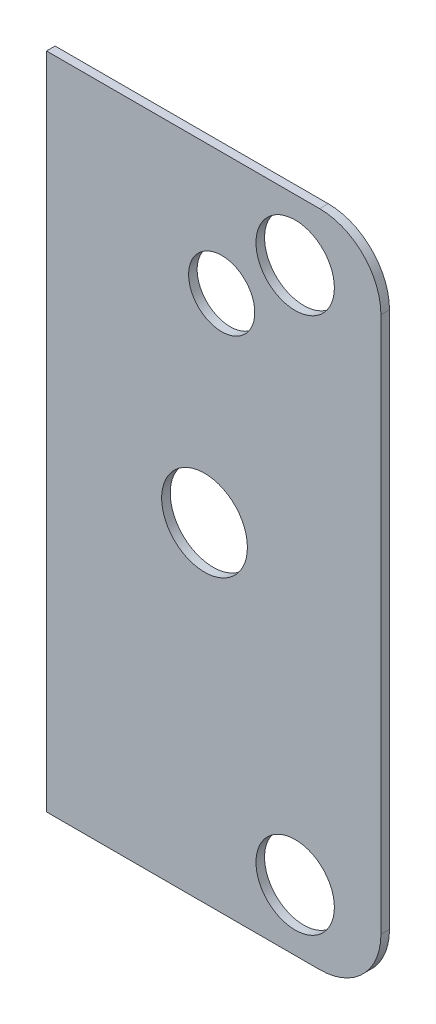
ISO-10303-21;
HEADER;
FILE_DESCRIPTION(('STEP AP214'),'2;1');
FILE_NAME('part.step','',(''),(''),'','','');
FILE_SCHEMA(('AUTOMOTIVE_DESIGN { 1 0 10303 214 1 1 1 1 }'));
ENDSEC;
DATA;
#1=APPLICATION_CONTEXT('core data for automotive mechanical design processes');
#2=APPLICATION_PROTOCOL_DEFINITION('international standard','automotive_design',2000,#1);
#3=PRODUCT_CONTEXT('',#1,'mechanical');
#4=PRODUCT('Part','Part','',(#3));
#5=PRODUCT_RELATED_PRODUCT_CATEGORY('part','',(#4));
#6=PRODUCT_DEFINITION_FORMATION('','',#4);
#7=PRODUCT_DEFINITION_CONTEXT('part definition',#1,'design');
#8=PRODUCT_DEFINITION('design','',#6,#7);
#9=PRODUCT_DEFINITION_SHAPE('','',#8);
#10=(LENGTH_UNIT() NAMED_UNIT(*) SI_UNIT(.MILLI.,.METRE.));
#11=(NAMED_UNIT(*) PLANE_ANGLE_UNIT() SI_UNIT($,.RADIAN.));
#12=(NAMED_UNIT(*) SI_UNIT($,.STERADIAN.) SOLID_ANGLE_UNIT());
#13=UNCERTAINTY_MEASURE_WITH_UNIT(LENGTH_MEASURE(1.E-05),#10,'distance_accuracy_value','');
#14=(GEOMETRIC_REPRESENTATION_CONTEXT(3) GLOBAL_UNCERTAINTY_ASSIGNED_CONTEXT((#13)) GLOBAL_UNIT_ASSIGNED_CONTEXT((#10,
#11,#12)) REPRESENTATION_CONTEXT('',''));
#15=CARTESIAN_POINT('',(0.,0.,0.));
#16=DIRECTION('',(0.,0.,1.));
#17=DIRECTION('',(1.,0.,0.));
#18=AXIS2_PLACEMENT_3D('',#15,#16,#17);
#19=CARTESIAN_POINT('',(0.,0.,0.7));
#20=DIRECTION('',(0.,0.,1.));
#21=DIRECTION('',(1.,0.,0.));
#22=AXIS2_PLACEMENT_3D('',#19,#20,#21);
#23=PLANE('',#22);
#24=CARTESIAN_POINT('',(21.9,16.9,0.7));
#25=DIRECTION('',(0.,0.,1.));
#26=DIRECTION('',(1.,0.,0.));
#27=AXIS2_PLACEMENT_3D('',#24,#25,#26);
#28=CIRCLE('',#27,2.7);
#29=CARTESIAN_POINT('',(24.6,16.9,0.7));
#30=VERTEX_POINT('',#29);
#31=EDGE_CURVE('E214',#30,#30,#28,.T.);
#32=ORIENTED_EDGE('',*,*,#31,.F.);
#33=EDGE_LOOP('',(#32));
#34=FACE_BOUND('',#33,.T.);
#35=CARTESIAN_POINT('',(27.9,21.9,0.699999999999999));
#36=DIRECTION('',(0.,0.,1.));
#37=DIRECTION('',(1.,0.,0.));
#38=AXIS2_PLACEMENT_3D('',#35,#36,#37);
#39=CIRCLE('',#38,3.2);
#40=CARTESIAN_POINT('',(31.1,21.9,0.699999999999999));
#41=VERTEX_POINT('',#40);
#42=EDGE_CURVE('E169',#41,#41,#39,.T.);
#43=ORIENTED_EDGE('',*,*,#42,.F.);
#44=EDGE_LOOP('',(#43));
#45=FACE_BOUND('',#44,.T.);
#46=CARTESIAN_POINT('',(27.9,-21.9,0.699999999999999));
#47=DIRECTION('',(0.,0.,1.));
#48=DIRECTION('',(1.,0.,0.));
#49=AXIS2_PLACEMENT_3D('',#46,#47,#48);
#50=CIRCLE('',#49,3.2);
#51=CARTESIAN_POINT('',(31.1,-21.9,0.699999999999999));
#52=VERTEX_POINT('',#51);
#53=EDGE_CURVE('E165',#52,#52,#50,.T.);
#54=ORIENTED_EDGE('',*,*,#53,.F.);
#55=EDGE_LOOP('',(#54));
#56=FACE_BOUND('',#55,.T.);
#57=CARTESIAN_POINT('',(20.5,0.,0.7));
#58=DIRECTION('',(0.,0.,1.));
#59=DIRECTION('',(1.,0.,0.));
#60=AXIS2_PLACEMENT_3D('',#57,#58,#59);
#61=CIRCLE('',#60,3.5);
#62=CARTESIAN_POINT('',(24.,0.,0.7));
#63=VERTEX_POINT('',#62);
#64=EDGE_CURVE('E161',#63,#63,#61,.T.);
#65=ORIENTED_EDGE('',*,*,#64,.F.);
#66=EDGE_LOOP('',(#65));
#67=FACE_BOUND('',#66,.T.);
#68=DIRECTION('',(1.,0.,0.));
#69=VECTOR('',#68,1.);
#70=CARTESIAN_POINT('',(0.,26.9,0.7));
#71=LINE('',#70,#69);
#72=CARTESIAN_POINT('',(7.59999999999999,26.9,0.7));
#73=VERTEX_POINT('',#72);
#74=CARTESIAN_POINT('',(29.9,26.9,0.7));
#75=VERTEX_POINT('',#74);
#76=EDGE_CURVE('E112',#73,#75,#71,.T.);
#77=ORIENTED_EDGE('',*,*,#76,.F.);
#78=DIRECTION('',(0.,-1.,0.));
#79=VECTOR('',#78,1.);
#80=CARTESIAN_POINT('',(7.6,0.,0.7));
#81=LINE('',#80,#79);
#82=CARTESIAN_POINT('',(7.6,-26.9,0.7));
#83=VERTEX_POINT('',#82);
#84=EDGE_CURVE('E103',#73,#83,#81,.T.);
#85=ORIENTED_EDGE('',*,*,#84,.T.);
#86=DIRECTION('',(1.,0.,0.));
#87=VECTOR('',#86,1.);
#88=CARTESIAN_POINT('',(0.,-26.9,0.7));
#89=LINE('',#88,#87);
#90=CARTESIAN_POINT('',(29.9,-26.9,0.7));
#91=VERTEX_POINT('',#90);
#92=EDGE_CURVE('E110',#83,#91,#89,.T.);
#93=ORIENTED_EDGE('',*,*,#92,.T.);
#94=CARTESIAN_POINT('',(29.9,-21.9,0.7));
#95=DIRECTION('',(0.,0.,1.));
#96=DIRECTION('',(1.,0.,0.));
#97=AXIS2_PLACEMENT_3D('',#94,#95,#96);
#98=CIRCLE('',#97,5.);
#99=CARTESIAN_POINT('',(34.9,-21.9,0.7));
#100=VERTEX_POINT('',#99);
#101=EDGE_CURVE('E121',#100,#91,#98,.F.);
#102=ORIENTED_EDGE('',*,*,#101,.F.);
#103=DIRECTION('',(0.,-1.,0.));
#104=VECTOR('',#103,1.);
#105=CARTESIAN_POINT('',(34.9,0.,0.7));
#106=LINE('',#105,#104);
#107=CARTESIAN_POINT('',(34.9,21.9,0.7));
#108=VERTEX_POINT('',#107);
#109=EDGE_CURVE('E129',#108,#100,#106,.T.);
#110=ORIENTED_EDGE('',*,*,#109,.F.);
#111=CARTESIAN_POINT('',(29.9,21.9,0.7));
#112=DIRECTION('',(0.,0.,1.));
#113=DIRECTION('',(1.,0.,0.));
#114=AXIS2_PLACEMENT_3D('',#111,#112,#113);
#115=CIRCLE('',#114,5.);
#116=EDGE_CURVE('E190',#75,#108,#115,.F.);
#117=ORIENTED_EDGE('',*,*,#116,.F.);
#118=EDGE_LOOP('',(#77,#85,#93,#102,#110,#117));
#119=FACE_BOUND('',#118,.T.);
#120=ADVANCED_FACE('F49',(#34,#45,#56,#67,#119),#23,.T.);
#121=CARTESIAN_POINT('',(0.,26.9,-9.3));
#122=DIRECTION('',(0.,-1.,0.));
#123=DIRECTION('',(0.,0.,-1.));
#124=AXIS2_PLACEMENT_3D('',#121,#122,#123);
#125=PLANE('',#124);
#126=DIRECTION('',(0.,0.,1.));
#127=VECTOR('',#126,1.);
#128=CARTESIAN_POINT('',(7.59999999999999,26.9,-9.3));
#129=LINE('',#128,#127);
#130=CARTESIAN_POINT('',(7.6,26.9,0.));
#131=VERTEX_POINT('',#130);
#132=EDGE_CURVE('E64',#131,#73,#129,.T.);
#133=ORIENTED_EDGE('',*,*,#132,.T.);
#134=ORIENTED_EDGE('',*,*,#76,.T.);
#135=DIRECTION('',(0.,0.,1.));
#136=VECTOR('',#135,1.);
#137=CARTESIAN_POINT('',(29.9,26.9,-9.3));
#138=LINE('',#137,#136);
#139=CARTESIAN_POINT('',(29.9,26.9,0.));
#140=VERTEX_POINT('',#139);
#141=EDGE_CURVE('E120',#140,#75,#138,.T.);
#142=ORIENTED_EDGE('',*,*,#141,.F.);
#143=DIRECTION('',(1.,0.,0.));
#144=VECTOR('',#143,1.);
#145=CARTESIAN_POINT('',(0.,26.9,0.));
#146=LINE('',#145,#144);
#147=EDGE_CURVE('E135',#131,#140,#146,.T.);
#148=ORIENTED_EDGE('',*,*,#147,.F.);
#149=EDGE_LOOP('',(#133,#134,#142,#148));
#150=FACE_BOUND('',#149,.T.);
#151=ADVANCED_FACE('F210',(#150),#125,.F.);
#152=CARTESIAN_POINT('',(0.,-26.9,-9.3));
#153=DIRECTION('',(0.,-1.,0.));
#154=DIRECTION('',(1.,0.,0.));
#155=AXIS2_PLACEMENT_3D('',#152,#153,#154);
#156=PLANE('',#155);
#157=ORIENTED_EDGE('',*,*,#92,.F.);
#158=DIRECTION('',(0.,0.,1.));
#159=VECTOR('',#158,1.);
#160=CARTESIAN_POINT('',(7.6,-26.9,-9.3));
#161=LINE('',#160,#159);
#162=CARTESIAN_POINT('',(7.6,-26.9,0.));
#163=VERTEX_POINT('',#162);
#164=EDGE_CURVE('E100',#163,#83,#161,.T.);
#165=ORIENTED_EDGE('',*,*,#164,.F.);
#166=DIRECTION('',(1.,0.,0.));
#167=VECTOR('',#166,1.);
#168=CARTESIAN_POINT('',(0.,-26.9,0.));
#169=LINE('',#168,#167);
#170=CARTESIAN_POINT('',(29.9,-26.9,0.));
#171=VERTEX_POINT('',#170);
#172=EDGE_CURVE('E58',#163,#171,#169,.T.);
#173=ORIENTED_EDGE('',*,*,#172,.T.);
#174=DIRECTION('',(0.,0.,1.));
#175=VECTOR('',#174,1.);
#176=CARTESIAN_POINT('',(29.9,-26.9,-9.3));
#177=LINE('',#176,#175);
#178=EDGE_CURVE('E117',#171,#91,#177,.T.);
#179=ORIENTED_EDGE('',*,*,#178,.T.);
#180=EDGE_LOOP('',(#157,#165,#173,#179));
#181=FACE_BOUND('',#180,.T.);
#182=ADVANCED_FACE('F116',(#181),#156,.T.);
#183=CARTESIAN_POINT('',(0.,0.,0.));
#184=DIRECTION('',(0.,0.,1.));
#185=DIRECTION('',(1.,0.,0.));
#186=AXIS2_PLACEMENT_3D('',#183,#184,#185);
#187=PLANE('',#186);
#188=CARTESIAN_POINT('',(21.9,16.9,0.));
#189=DIRECTION('',(0.,0.,1.));
#190=DIRECTION('',(1.,0.,0.));
#191=AXIS2_PLACEMENT_3D('',#188,#189,#190);
#192=CIRCLE('',#191,2.7);
#193=CARTESIAN_POINT('',(24.6,16.9,0.));
#194=VERTEX_POINT('',#193);
#195=EDGE_CURVE('E114',#194,#194,#192,.T.);
#196=ORIENTED_EDGE('',*,*,#195,.T.);
#197=EDGE_LOOP('',(#196));
#198=FACE_BOUND('',#197,.T.);
#199=CARTESIAN_POINT('',(20.5,0.,0.));
#200=DIRECTION('',(0.,0.,1.));
#201=DIRECTION('',(1.,0.,0.));
#202=AXIS2_PLACEMENT_3D('',#199,#200,#201);
#203=CIRCLE('',#202,3.5);
#204=CARTESIAN_POINT('',(24.,0.,0.));
#205=VERTEX_POINT('',#204);
#206=EDGE_CURVE('E157',#205,#205,#203,.T.);
#207=ORIENTED_EDGE('',*,*,#206,.T.);
#208=EDGE_LOOP('',(#207));
#209=FACE_BOUND('',#208,.T.);
#210=CARTESIAN_POINT('',(27.9,-21.9,0.));
#211=DIRECTION('',(0.,0.,1.));
#212=DIRECTION('',(1.,0.,0.));
#213=AXIS2_PLACEMENT_3D('',#210,#211,#212);
#214=CIRCLE('',#213,3.2);
#215=CARTESIAN_POINT('',(31.1,-21.9,0.));
#216=VERTEX_POINT('',#215);
#217=EDGE_CURVE('E162',#216,#216,#214,.T.);
#218=ORIENTED_EDGE('',*,*,#217,.T.);
#219=EDGE_LOOP('',(#218));
#220=FACE_BOUND('',#219,.T.);
#221=CARTESIAN_POINT('',(27.9,21.9,0.));
#222=DIRECTION('',(0.,0.,1.));
#223=DIRECTION('',(1.,0.,0.));
#224=AXIS2_PLACEMENT_3D('',#221,#222,#223);
#225=CIRCLE('',#224,3.2);
#226=CARTESIAN_POINT('',(31.1,21.9,0.));
#227=VERTEX_POINT('',#226);
#228=EDGE_CURVE('E166',#227,#227,#225,.T.);
#229=ORIENTED_EDGE('',*,*,#228,.T.);
#230=EDGE_LOOP('',(#229));
#231=FACE_BOUND('',#230,.T.);
#232=DIRECTION('',(0.,-1.,0.));
#233=VECTOR('',#232,1.);
#234=CARTESIAN_POINT('',(7.6,0.,0.));
#235=LINE('',#234,#233);
#236=EDGE_CURVE('E11',#131,#163,#235,.T.);
#237=ORIENTED_EDGE('',*,*,#236,.F.);
#238=ORIENTED_EDGE('',*,*,#147,.T.);
#239=CARTESIAN_POINT('',(29.9,21.9,0.));
#240=DIRECTION('',(0.,0.,1.));
#241=DIRECTION('',(1.,0.,0.));
#242=AXIS2_PLACEMENT_3D('',#239,#240,#241);
#243=CIRCLE('',#242,5.);
#244=CARTESIAN_POINT('',(34.9,21.9,0.));
#245=VERTEX_POINT('',#244);
#246=EDGE_CURVE('E143',#140,#245,#243,.F.);
#247=ORIENTED_EDGE('',*,*,#246,.T.);
#248=DIRECTION('',(0.,-1.,0.));
#249=VECTOR('',#248,1.);
#250=CARTESIAN_POINT('',(34.9,0.,0.));
#251=LINE('',#250,#249);
#252=CARTESIAN_POINT('',(34.9,-21.9,0.));
#253=VERTEX_POINT('',#252);
#254=EDGE_CURVE('E147',#245,#253,#251,.T.);
#255=ORIENTED_EDGE('',*,*,#254,.T.);
#256=CARTESIAN_POINT('',(29.9,-21.9,0.));
#257=DIRECTION('',(0.,0.,1.));
#258=DIRECTION('',(1.,0.,0.));
#259=AXIS2_PLACEMENT_3D('',#256,#257,#258);
#260=CIRCLE('',#259,5.);
#261=EDGE_CURVE('E151',#253,#171,#260,.F.);
#262=ORIENTED_EDGE('',*,*,#261,.T.);
#263=ORIENTED_EDGE('',*,*,#172,.F.);
#264=EDGE_LOOP('',(#237,#238,#247,#255,#262,#263));
#265=FACE_BOUND('',#264,.T.);
#266=ADVANCED_FACE('F51',(#198,#209,#220,#231,#265),#187,.F.);
#267=CARTESIAN_POINT('',(29.9,21.9,-9.3));
#268=DIRECTION('',(0.,0.,1.));
#269=DIRECTION('',(1.,0.,0.));
#270=AXIS2_PLACEMENT_3D('',#267,#268,#269);
#271=CYLINDRICAL_SURFACE('',#270,5.);
#272=ORIENTED_EDGE('',*,*,#141,.T.);
#273=ORIENTED_EDGE('',*,*,#116,.T.);
#274=DIRECTION('',(0.,0.,1.));
#275=VECTOR('',#274,1.);
#276=CARTESIAN_POINT('',(34.9,21.9,-9.3));
#277=LINE('',#276,#275);
#278=EDGE_CURVE('E126',#245,#108,#277,.T.);
#279=ORIENTED_EDGE('',*,*,#278,.F.);
#280=ORIENTED_EDGE('',*,*,#246,.F.);
#281=EDGE_LOOP('',(#272,#273,#279,#280));
#282=FACE_BOUND('',#281,.T.);
#283=ADVANCED_FACE('F206',(#282),#271,.T.);
#284=CARTESIAN_POINT('',(34.9,0.,-9.3));
#285=DIRECTION('',(-1.,0.,0.));
#286=DIRECTION('',(0.,-1.,0.));
#287=AXIS2_PLACEMENT_3D('',#284,#285,#286);
#288=PLANE('',#287);
#289=ORIENTED_EDGE('',*,*,#278,.T.);
#290=ORIENTED_EDGE('',*,*,#109,.T.);
#291=DIRECTION('',(0.,0.,1.));
#292=VECTOR('',#291,1.);
#293=CARTESIAN_POINT('',(34.9,-21.9,-9.3));
#294=LINE('',#293,#292);
#295=EDGE_CURVE('E136',#253,#100,#294,.T.);
#296=ORIENTED_EDGE('',*,*,#295,.F.);
#297=ORIENTED_EDGE('',*,*,#254,.F.);
#298=EDGE_LOOP('',(#289,#290,#296,#297));
#299=FACE_BOUND('',#298,.T.);
#300=ADVANCED_FACE('F199',(#299),#288,.F.);
#301=CARTESIAN_POINT('',(29.9,-21.9,-9.3));
#302=DIRECTION('',(0.,0.,1.));
#303=DIRECTION('',(1.,0.,0.));
#304=AXIS2_PLACEMENT_3D('',#301,#302,#303);
#305=CYLINDRICAL_SURFACE('',#304,5.);
#306=ORIENTED_EDGE('',*,*,#295,.T.);
#307=ORIENTED_EDGE('',*,*,#101,.T.);
#308=ORIENTED_EDGE('',*,*,#178,.F.);
#309=ORIENTED_EDGE('',*,*,#261,.F.);
#310=EDGE_LOOP('',(#306,#307,#308,#309));
#311=FACE_BOUND('',#310,.T.);
#312=ADVANCED_FACE('F202',(#311),#305,.T.);
#313=CARTESIAN_POINT('',(20.5,0.,-9.3));
#314=DIRECTION('',(0.,0.,1.));
#315=DIRECTION('',(1.,0.,0.));
#316=AXIS2_PLACEMENT_3D('',#313,#314,#315);
#317=CYLINDRICAL_SURFACE('',#316,3.5);
#318=ORIENTED_EDGE('',*,*,#64,.T.);
#319=EDGE_LOOP('',(#318));
#320=FACE_BOUND('',#319,.T.);
#321=ORIENTED_EDGE('',*,*,#206,.F.);
#322=EDGE_LOOP('',(#321));
#323=FACE_BOUND('',#322,.T.);
#324=ADVANCED_FACE('F237',(#320,#323),#317,.F.);
#325=CARTESIAN_POINT('',(27.9,-21.9,-8.7));
#326=DIRECTION('',(0.,0.,1.));
#327=DIRECTION('',(1.,0.,0.));
#328=AXIS2_PLACEMENT_3D('',#325,#326,#327);
#329=CYLINDRICAL_SURFACE('',#328,3.2);
#330=ORIENTED_EDGE('',*,*,#53,.T.);
#331=EDGE_LOOP('',(#330));
#332=FACE_BOUND('',#331,.T.);
#333=ORIENTED_EDGE('',*,*,#217,.F.);
#334=EDGE_LOOP('',(#333));
#335=FACE_BOUND('',#334,.T.);
#336=ADVANCED_FACE('F240',(#332,#335),#329,.F.);
#337=CARTESIAN_POINT('',(27.9,21.9,-8.7));
#338=DIRECTION('',(0.,0.,1.));
#339=DIRECTION('',(1.,0.,0.));
#340=AXIS2_PLACEMENT_3D('',#337,#338,#339);
#341=CYLINDRICAL_SURFACE('',#340,3.2);
#342=ORIENTED_EDGE('',*,*,#42,.T.);
#343=EDGE_LOOP('',(#342));
#344=FACE_BOUND('',#343,.T.);
#345=ORIENTED_EDGE('',*,*,#228,.F.);
#346=EDGE_LOOP('',(#345));
#347=FACE_BOUND('',#346,.T.);
#348=ADVANCED_FACE('F248',(#344,#347),#341,.F.);
#349=CARTESIAN_POINT('',(7.6,0.,-9.3));
#350=DIRECTION('',(-1.,0.,0.));
#351=DIRECTION('',(0.,-1.,0.));
#352=AXIS2_PLACEMENT_3D('',#349,#350,#351);
#353=PLANE('',#352);
#354=ORIENTED_EDGE('',*,*,#236,.T.);
#355=ORIENTED_EDGE('',*,*,#164,.T.);
#356=ORIENTED_EDGE('',*,*,#84,.F.);
#357=ORIENTED_EDGE('',*,*,#132,.F.);
#358=EDGE_LOOP('',(#354,#355,#356,#357));
#359=FACE_BOUND('',#358,.T.);
#360=ADVANCED_FACE('F102',(#359),#353,.T.);
#361=CARTESIAN_POINT('',(21.9,16.9,0.));
#362=DIRECTION('',(0.,0.,1.));
#363=DIRECTION('',(1.,0.,0.));
#364=AXIS2_PLACEMENT_3D('',#361,#362,#363);
#365=CYLINDRICAL_SURFACE('',#364,2.7);
#366=ORIENTED_EDGE('',*,*,#195,.F.);
#367=EDGE_LOOP('',(#366));
#368=FACE_BOUND('',#367,.T.);
#369=ORIENTED_EDGE('',*,*,#31,.T.);
#370=EDGE_LOOP('',(#369));
#371=FACE_BOUND('',#370,.T.);
#372=ADVANCED_FACE('F224',(#368,#371),#365,.F.);
#373=CLOSED_SHELL('',(#120,#151,#182,#266,#283,#300,#312,#324,#336,#348,#360,#372));
#374=MANIFOLD_SOLID_BREP('B2',#373);
#375=ADVANCED_BREP_SHAPE_REPRESENTATION('',(#18,#374),#14);
#376=SHAPE_DEFINITION_REPRESENTATION(#9,#375);
ENDSEC;
END-ISO-10303-21;
